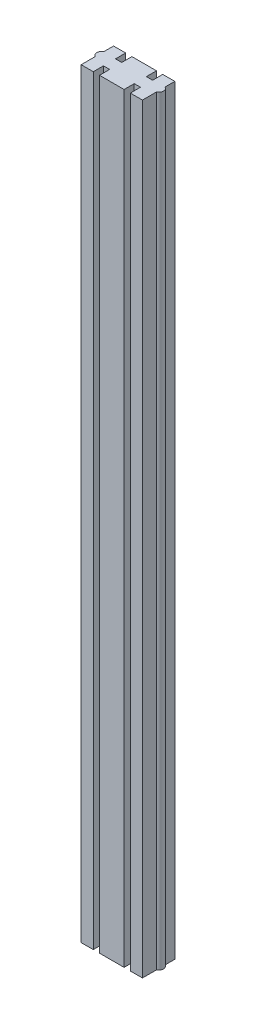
ISO-10303-21;
HEADER;
FILE_DESCRIPTION(('STEP AP214'),'2;1');
FILE_NAME('part.step','',(''),(''),'','','');
FILE_SCHEMA(('AUTOMOTIVE_DESIGN { 1 0 10303 214 1 1 1 1 }'));
ENDSEC;
DATA;
#1=APPLICATION_CONTEXT('core data for automotive mechanical design processes');
#2=APPLICATION_PROTOCOL_DEFINITION('international standard','automotive_design',2000,#1);
#3=PRODUCT_CONTEXT('',#1,'mechanical');
#4=PRODUCT('Part','Part','',(#3));
#5=PRODUCT_RELATED_PRODUCT_CATEGORY('part','',(#4));
#6=PRODUCT_DEFINITION_FORMATION('','',#4);
#7=PRODUCT_DEFINITION_CONTEXT('part definition',#1,'design');
#8=PRODUCT_DEFINITION('design','',#6,#7);
#9=PRODUCT_DEFINITION_SHAPE('','',#8);
#10=(LENGTH_UNIT() NAMED_UNIT(*) SI_UNIT(.MILLI.,.METRE.));
#11=(NAMED_UNIT(*) PLANE_ANGLE_UNIT() SI_UNIT($,.RADIAN.));
#12=(NAMED_UNIT(*) SI_UNIT($,.STERADIAN.) SOLID_ANGLE_UNIT());
#13=UNCERTAINTY_MEASURE_WITH_UNIT(LENGTH_MEASURE(1.E-05),#10,'distance_accuracy_value','');
#14=(GEOMETRIC_REPRESENTATION_CONTEXT(3) GLOBAL_UNCERTAINTY_ASSIGNED_CONTEXT((#13)) GLOBAL_UNIT_ASSIGNED_CONTEXT((#10,
#11,#12)) REPRESENTATION_CONTEXT('',''));
#15=CARTESIAN_POINT('',(0.,0.,0.));
#16=DIRECTION('',(0.,0.,1.));
#17=DIRECTION('',(1.,0.,0.));
#18=AXIS2_PLACEMENT_3D('',#15,#16,#17);
#19=CARTESIAN_POINT('',(0.,495.0079,0.));
#20=DIRECTION('',(1.,0.,0.));
#21=DIRECTION('',(0.,0.,-1.));
#22=AXIS2_PLACEMENT_3D('',#19,#20,#21);
#23=PLANE('',#22);
#24=DIRECTION('',(0.,0.,1.));
#25=VECTOR('',#24,1.);
#26=CARTESIAN_POINT('',(0.,0.,0.));
#27=LINE('',#26,#25);
#28=CARTESIAN_POINT('',(0.,0.,-9.16718712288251));
#29=VERTEX_POINT('',#28);
#30=CARTESIAN_POINT('',(0.,0.,0.));
#31=VERTEX_POINT('',#30);
#32=EDGE_CURVE('E236',#29,#31,#27,.T.);
#33=ORIENTED_EDGE('',*,*,#32,.T.);
#34=DIRECTION('',(0.,-1.,0.));
#35=VECTOR('',#34,1.);
#36=CARTESIAN_POINT('',(0.,495.0079,0.));
#37=LINE('',#36,#35);
#38=CARTESIAN_POINT('',(0.,495.0079,0.));
#39=VERTEX_POINT('',#38);
#40=EDGE_CURVE('E11',#39,#31,#37,.T.);
#41=ORIENTED_EDGE('',*,*,#40,.F.);
#42=DIRECTION('',(0.,0.,1.));
#43=VECTOR('',#42,1.);
#44=CARTESIAN_POINT('',(0.,495.0079,0.));
#45=LINE('',#44,#43);
#46=CARTESIAN_POINT('',(0.,495.0079,-9.16718712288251));
#47=VERTEX_POINT('',#46);
#48=EDGE_CURVE('E306',#47,#39,#45,.T.);
#49=ORIENTED_EDGE('',*,*,#48,.F.);
#50=DIRECTION('',(0.,-1.,0.));
#51=VECTOR('',#50,1.);
#52=CARTESIAN_POINT('',(0.,495.0079,-9.16718712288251));
#53=LINE('',#52,#51);
#54=EDGE_CURVE('E232',#47,#29,#53,.T.);
#55=ORIENTED_EDGE('',*,*,#54,.T.);
#56=EDGE_LOOP('',(#33,#41,#49,#55));
#57=FACE_BOUND('',#56,.T.);
#58=ADVANCED_FACE('F39',(#57),#23,.F.);
#59=CARTESIAN_POINT('',(0.,495.0079,0.));
#60=DIRECTION('',(0.,0.,-1.));
#61=DIRECTION('',(-1.,0.,0.));
#62=AXIS2_PLACEMENT_3D('',#59,#60,#61);
#63=PLANE('',#62);
#64=DIRECTION('',(1.,0.,0.));
#65=VECTOR('',#64,1.);
#66=CARTESIAN_POINT('',(0.,0.,0.));
#67=LINE('',#66,#65);
#68=CARTESIAN_POINT('',(7.874,0.,0.));
#69=VERTEX_POINT('',#68);
#70=EDGE_CURVE('E240',#31,#69,#67,.T.);
#71=ORIENTED_EDGE('',*,*,#70,.T.);
#72=DIRECTION('',(0.,-1.,0.));
#73=VECTOR('',#72,1.);
#74=CARTESIAN_POINT('',(7.874,495.0079,0.));
#75=LINE('',#74,#73);
#76=CARTESIAN_POINT('',(7.874,495.0079,0.));
#77=VERTEX_POINT('',#76);
#78=EDGE_CURVE('E48',#77,#69,#75,.T.);
#79=ORIENTED_EDGE('',*,*,#78,.F.);
#80=DIRECTION('',(1.,0.,0.));
#81=VECTOR('',#80,1.);
#82=CARTESIAN_POINT('',(0.,495.0079,0.));
#83=LINE('',#82,#81);
#84=EDGE_CURVE('E147',#39,#77,#83,.T.);
#85=ORIENTED_EDGE('',*,*,#84,.F.);
#86=ORIENTED_EDGE('',*,*,#40,.T.);
#87=EDGE_LOOP('',(#71,#79,#85,#86));
#88=FACE_BOUND('',#87,.T.);
#89=ADVANCED_FACE('F484',(#88),#63,.F.);
#90=CARTESIAN_POINT('',(7.874,495.0079,0.));
#91=DIRECTION('',(-1.,0.,0.));
#92=DIRECTION('',(0.,0.,1.));
#93=AXIS2_PLACEMENT_3D('',#90,#91,#92);
#94=PLANE('',#93);
#95=DIRECTION('',(0.,0.,-1.));
#96=VECTOR('',#95,1.);
#97=CARTESIAN_POINT('',(7.874,0.,0.));
#98=LINE('',#97,#96);
#99=CARTESIAN_POINT('',(7.874,0.,-6.604));
#100=VERTEX_POINT('',#99);
#101=EDGE_CURVE('E243',#69,#100,#98,.T.);
#102=ORIENTED_EDGE('',*,*,#101,.T.);
#103=DIRECTION('',(0.,-1.,0.));
#104=VECTOR('',#103,1.);
#105=CARTESIAN_POINT('',(7.874,495.0079,-6.604));
#106=LINE('',#105,#104);
#107=CARTESIAN_POINT('',(7.874,495.0079,-6.604));
#108=VERTEX_POINT('',#107);
#109=EDGE_CURVE('E381',#108,#100,#106,.T.);
#110=ORIENTED_EDGE('',*,*,#109,.F.);
#111=DIRECTION('',(0.,0.,-1.));
#112=VECTOR('',#111,1.);
#113=CARTESIAN_POINT('',(7.874,495.0079,0.));
#114=LINE('',#113,#112);
#115=EDGE_CURVE('E391',#77,#108,#114,.T.);
#116=ORIENTED_EDGE('',*,*,#115,.F.);
#117=ORIENTED_EDGE('',*,*,#78,.T.);
#118=EDGE_LOOP('',(#102,#110,#116,#117));
#119=FACE_BOUND('',#118,.T.);
#120=ADVANCED_FACE('F389',(#119),#94,.F.);
#121=CARTESIAN_POINT('',(7.874,495.0079,-6.604));
#122=DIRECTION('',(0.,0.,-1.));
#123=DIRECTION('',(-1.,0.,0.));
#124=AXIS2_PLACEMENT_3D('',#121,#122,#123);
#125=PLANE('',#124);
#126=DIRECTION('',(1.,0.,0.));
#127=VECTOR('',#126,1.);
#128=CARTESIAN_POINT('',(7.874,0.,-6.604));
#129=LINE('',#128,#127);
#130=CARTESIAN_POINT('',(11.938,0.,-6.604));
#131=VERTEX_POINT('',#130);
#132=EDGE_CURVE('E246',#100,#131,#129,.T.);
#133=ORIENTED_EDGE('',*,*,#132,.T.);
#134=DIRECTION('',(0.,-1.,0.));
#135=VECTOR('',#134,1.);
#136=CARTESIAN_POINT('',(11.938,495.0079,-6.604));
#137=LINE('',#136,#135);
#138=CARTESIAN_POINT('',(11.938,495.0079,-6.604));
#139=VERTEX_POINT('',#138);
#140=EDGE_CURVE('E377',#139,#131,#137,.T.);
#141=ORIENTED_EDGE('',*,*,#140,.F.);
#142=DIRECTION('',(1.,0.,0.));
#143=VECTOR('',#142,1.);
#144=CARTESIAN_POINT('',(7.874,495.0079,-6.604));
#145=LINE('',#144,#143);
#146=EDGE_CURVE('E410',#108,#139,#145,.T.);
#147=ORIENTED_EDGE('',*,*,#146,.F.);
#148=ORIENTED_EDGE('',*,*,#109,.T.);
#149=EDGE_LOOP('',(#133,#141,#147,#148));
#150=FACE_BOUND('',#149,.T.);
#151=ADVANCED_FACE('F400',(#150),#125,.F.);
#152=CARTESIAN_POINT('',(11.938,495.0079,0.));
#153=DIRECTION('',(1.,0.,0.));
#154=DIRECTION('',(0.,0.,-1.));
#155=AXIS2_PLACEMENT_3D('',#152,#153,#154);
#156=PLANE('',#155);
#157=DIRECTION('',(0.,0.,1.));
#158=VECTOR('',#157,1.);
#159=CARTESIAN_POINT('',(11.938,0.,0.));
#160=LINE('',#159,#158);
#161=CARTESIAN_POINT('',(11.938,0.,0.));
#162=VERTEX_POINT('',#161);
#163=EDGE_CURVE('E249',#131,#162,#160,.T.);
#164=ORIENTED_EDGE('',*,*,#163,.T.);
#165=DIRECTION('',(0.,-1.,0.));
#166=VECTOR('',#165,1.);
#167=CARTESIAN_POINT('',(11.938,495.0079,0.));
#168=LINE('',#167,#166);
#169=CARTESIAN_POINT('',(11.938,495.0079,0.));
#170=VERTEX_POINT('',#169);
#171=EDGE_CURVE('E373',#170,#162,#168,.T.);
#172=ORIENTED_EDGE('',*,*,#171,.F.);
#173=DIRECTION('',(0.,0.,1.));
#174=VECTOR('',#173,1.);
#175=CARTESIAN_POINT('',(11.938,495.0079,0.));
#176=LINE('',#175,#174);
#177=EDGE_CURVE('E406',#139,#170,#176,.T.);
#178=ORIENTED_EDGE('',*,*,#177,.F.);
#179=ORIENTED_EDGE('',*,*,#140,.T.);
#180=EDGE_LOOP('',(#164,#172,#178,#179));
#181=FACE_BOUND('',#180,.T.);
#182=ADVANCED_FACE('F404',(#181),#156,.F.);
#183=CARTESIAN_POINT('',(11.938,495.0079,0.));
#184=DIRECTION('',(0.,0.,-1.));
#185=DIRECTION('',(-1.,0.,0.));
#186=AXIS2_PLACEMENT_3D('',#183,#184,#185);
#187=PLANE('',#186);
#188=DIRECTION('',(1.,0.,0.));
#189=VECTOR('',#188,1.);
#190=CARTESIAN_POINT('',(11.938,0.,0.));
#191=LINE('',#190,#189);
#192=CARTESIAN_POINT('',(27.94,0.,0.));
#193=VERTEX_POINT('',#192);
#194=EDGE_CURVE('E252',#162,#193,#191,.T.);
#195=ORIENTED_EDGE('',*,*,#194,.T.);
#196=DIRECTION('',(0.,-1.,0.));
#197=VECTOR('',#196,1.);
#198=CARTESIAN_POINT('',(27.94,495.0079,0.));
#199=LINE('',#198,#197);
#200=CARTESIAN_POINT('',(27.94,495.0079,0.));
#201=VERTEX_POINT('',#200);
#202=EDGE_CURVE('E369',#201,#193,#199,.T.);
#203=ORIENTED_EDGE('',*,*,#202,.F.);
#204=DIRECTION('',(1.,0.,0.));
#205=VECTOR('',#204,1.);
#206=CARTESIAN_POINT('',(11.938,495.0079,0.));
#207=LINE('',#206,#205);
#208=EDGE_CURVE('E409',#170,#201,#207,.T.);
#209=ORIENTED_EDGE('',*,*,#208,.F.);
#210=ORIENTED_EDGE('',*,*,#171,.T.);
#211=EDGE_LOOP('',(#195,#203,#209,#210));
#212=FACE_BOUND('',#211,.T.);
#213=ADVANCED_FACE('F497',(#212),#187,.F.);
#214=CARTESIAN_POINT('',(27.94,495.0079,0.));
#215=DIRECTION('',(-1.,0.,0.));
#216=DIRECTION('',(0.,0.,1.));
#217=AXIS2_PLACEMENT_3D('',#214,#215,#216);
#218=PLANE('',#217);
#219=DIRECTION('',(0.,0.,-1.));
#220=VECTOR('',#219,1.);
#221=CARTESIAN_POINT('',(27.94,0.,0.));
#222=LINE('',#221,#220);
#223=CARTESIAN_POINT('',(27.94,0.,-6.604));
#224=VERTEX_POINT('',#223);
#225=EDGE_CURVE('E255',#193,#224,#222,.T.);
#226=ORIENTED_EDGE('',*,*,#225,.T.);
#227=DIRECTION('',(0.,-1.,0.));
#228=VECTOR('',#227,1.);
#229=CARTESIAN_POINT('',(27.94,495.0079,-6.604));
#230=LINE('',#229,#228);
#231=CARTESIAN_POINT('',(27.94,495.0079,-6.604));
#232=VERTEX_POINT('',#231);
#233=EDGE_CURVE('E365',#232,#224,#230,.T.);
#234=ORIENTED_EDGE('',*,*,#233,.F.);
#235=DIRECTION('',(0.,0.,-1.));
#236=VECTOR('',#235,1.);
#237=CARTESIAN_POINT('',(27.94,495.0079,0.));
#238=LINE('',#237,#236);
#239=EDGE_CURVE('E414',#201,#232,#238,.T.);
#240=ORIENTED_EDGE('',*,*,#239,.F.);
#241=ORIENTED_EDGE('',*,*,#202,.T.);
#242=EDGE_LOOP('',(#226,#234,#240,#241));
#243=FACE_BOUND('',#242,.T.);
#244=ADVANCED_FACE('F500',(#243),#218,.F.);
#245=CARTESIAN_POINT('',(32.004,495.0079,-6.604));
#246=DIRECTION('',(0.,0.,-1.));
#247=DIRECTION('',(-1.,0.,0.));
#248=AXIS2_PLACEMENT_3D('',#245,#246,#247);
#249=PLANE('',#248);
#250=DIRECTION('',(1.,0.,0.));
#251=VECTOR('',#250,1.);
#252=CARTESIAN_POINT('',(32.004,0.,-6.604));
#253=LINE('',#252,#251);
#254=CARTESIAN_POINT('',(32.004,0.,-6.604));
#255=VERTEX_POINT('',#254);
#256=EDGE_CURVE('E258',#224,#255,#253,.T.);
#257=ORIENTED_EDGE('',*,*,#256,.T.);
#258=DIRECTION('',(0.,-1.,0.));
#259=VECTOR('',#258,1.);
#260=CARTESIAN_POINT('',(32.004,495.0079,-6.604));
#261=LINE('',#260,#259);
#262=CARTESIAN_POINT('',(32.004,495.0079,-6.604));
#263=VERTEX_POINT('',#262);
#264=EDGE_CURVE('E361',#263,#255,#261,.T.);
#265=ORIENTED_EDGE('',*,*,#264,.F.);
#266=DIRECTION('',(1.,0.,0.));
#267=VECTOR('',#266,1.);
#268=CARTESIAN_POINT('',(32.004,495.0079,-6.604));
#269=LINE('',#268,#267);
#270=EDGE_CURVE('E421',#232,#263,#269,.T.);
#271=ORIENTED_EDGE('',*,*,#270,.F.);
#272=ORIENTED_EDGE('',*,*,#233,.T.);
#273=EDGE_LOOP('',(#257,#265,#271,#272));
#274=FACE_BOUND('',#273,.T.);
#275=ADVANCED_FACE('F504',(#274),#249,.F.);
#276=CARTESIAN_POINT('',(32.004,495.0079,0.));
#277=DIRECTION('',(1.,0.,0.));
#278=DIRECTION('',(0.,0.,-1.));
#279=AXIS2_PLACEMENT_3D('',#276,#277,#278);
#280=PLANE('',#279);
#281=DIRECTION('',(0.,0.,1.));
#282=VECTOR('',#281,1.);
#283=CARTESIAN_POINT('',(32.004,0.,0.));
#284=LINE('',#283,#282);
#285=CARTESIAN_POINT('',(32.004,0.,0.));
#286=VERTEX_POINT('',#285);
#287=EDGE_CURVE('E261',#255,#286,#284,.T.);
#288=ORIENTED_EDGE('',*,*,#287,.T.);
#289=DIRECTION('',(0.,-1.,0.));
#290=VECTOR('',#289,1.);
#291=CARTESIAN_POINT('',(32.004,495.0079,0.));
#292=LINE('',#291,#290);
#293=CARTESIAN_POINT('',(32.004,495.0079,0.));
#294=VERTEX_POINT('',#293);
#295=EDGE_CURVE('E357',#294,#286,#292,.T.);
#296=ORIENTED_EDGE('',*,*,#295,.F.);
#297=DIRECTION('',(0.,0.,1.));
#298=VECTOR('',#297,1.);
#299=CARTESIAN_POINT('',(32.004,495.0079,0.));
#300=LINE('',#299,#298);
#301=EDGE_CURVE('E424',#263,#294,#300,.T.);
#302=ORIENTED_EDGE('',*,*,#301,.F.);
#303=ORIENTED_EDGE('',*,*,#264,.T.);
#304=EDGE_LOOP('',(#288,#296,#302,#303));
#305=FACE_BOUND('',#304,.T.);
#306=ADVANCED_FACE('F508',(#305),#280,.F.);
#307=CARTESIAN_POINT('',(32.004,495.0079,0.));
#308=DIRECTION('',(0.,0.,-1.));
#309=DIRECTION('',(-1.,0.,0.));
#310=AXIS2_PLACEMENT_3D('',#307,#308,#309);
#311=PLANE('',#310);
#312=DIRECTION('',(1.,0.,0.));
#313=VECTOR('',#312,1.);
#314=CARTESIAN_POINT('',(32.004,0.,0.));
#315=LINE('',#314,#313);
#316=CARTESIAN_POINT('',(39.878,0.,0.));
#317=VERTEX_POINT('',#316);
#318=EDGE_CURVE('E264',#286,#317,#315,.T.);
#319=ORIENTED_EDGE('',*,*,#318,.T.);
#320=DIRECTION('',(0.,-1.,0.));
#321=VECTOR('',#320,1.);
#322=CARTESIAN_POINT('',(39.878,495.0079,0.));
#323=LINE('',#322,#321);
#324=CARTESIAN_POINT('',(39.878,495.0079,0.));
#325=VERTEX_POINT('',#324);
#326=EDGE_CURVE('E353',#325,#317,#323,.T.);
#327=ORIENTED_EDGE('',*,*,#326,.F.);
#328=DIRECTION('',(1.,0.,0.));
#329=VECTOR('',#328,1.);
#330=CARTESIAN_POINT('',(32.004,495.0079,0.));
#331=LINE('',#330,#329);
#332=EDGE_CURVE('E427',#294,#325,#331,.T.);
#333=ORIENTED_EDGE('',*,*,#332,.F.);
#334=ORIENTED_EDGE('',*,*,#295,.T.);
#335=EDGE_LOOP('',(#319,#327,#333,#334));
#336=FACE_BOUND('',#335,.T.);
#337=ADVANCED_FACE('F512',(#336),#311,.F.);
#338=CARTESIAN_POINT('',(39.878,495.0079,0.));
#339=DIRECTION('',(-1.,0.,0.));
#340=DIRECTION('',(0.,0.,1.));
#341=AXIS2_PLACEMENT_3D('',#338,#339,#340);
#342=PLANE('',#341);
#343=DIRECTION('',(0.,0.,-1.));
#344=VECTOR('',#343,1.);
#345=CARTESIAN_POINT('',(39.878,0.,0.));
#346=LINE('',#345,#344);
#347=CARTESIAN_POINT('',(39.878,0.,-9.16718712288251));
#348=VERTEX_POINT('',#347);
#349=EDGE_CURVE('E267',#317,#348,#346,.T.);
#350=ORIENTED_EDGE('',*,*,#349,.T.);
#351=DIRECTION('',(0.,-1.,0.));
#352=VECTOR('',#351,1.);
#353=CARTESIAN_POINT('',(39.878,495.0079,-9.16718712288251));
#354=LINE('',#353,#352);
#355=CARTESIAN_POINT('',(39.878,495.0079,-9.16718712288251));
#356=VERTEX_POINT('',#355);
#357=EDGE_CURVE('E349',#356,#348,#354,.T.);
#358=ORIENTED_EDGE('',*,*,#357,.F.);
#359=DIRECTION('',(0.,0.,-1.));
#360=VECTOR('',#359,1.);
#361=CARTESIAN_POINT('',(39.878,495.0079,0.));
#362=LINE('',#361,#360);
#363=EDGE_CURVE('E430',#325,#356,#362,.T.);
#364=ORIENTED_EDGE('',*,*,#363,.F.);
#365=ORIENTED_EDGE('',*,*,#326,.T.);
#366=EDGE_LOOP('',(#350,#358,#364,#365));
#367=FACE_BOUND('',#366,.T.);
#368=ADVANCED_FACE('F516',(#367),#342,.F.);
#369=CARTESIAN_POINT('',(38.608,495.0079,-11.938));
#370=DIRECTION('',(0.,-1.,0.));
#371=DIRECTION('',(0.,0.,-1.));
#372=AXIS2_PLACEMENT_3D('',#369,#370,#371);
#373=CYLINDRICAL_SURFACE('',#372,3.04800000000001);
#374=CARTESIAN_POINT('',(38.608,0.,-11.938));
#375=DIRECTION('',(0.,1.,0.));
#376=DIRECTION('',(0.,0.,1.));
#377=AXIS2_PLACEMENT_3D('',#374,#375,#376);
#378=CIRCLE('',#377,3.04800000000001);
#379=CARTESIAN_POINT('',(39.878,0.,-14.7088128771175));
#380=VERTEX_POINT('',#379);
#381=EDGE_CURVE('E270',#348,#380,#378,.T.);
#382=ORIENTED_EDGE('',*,*,#381,.T.);
#383=DIRECTION('',(0.,-1.,0.));
#384=VECTOR('',#383,1.);
#385=CARTESIAN_POINT('',(39.878,495.0079,-14.7088128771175));
#386=LINE('',#385,#384);
#387=CARTESIAN_POINT('',(39.878,495.0079,-14.7088128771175));
#388=VERTEX_POINT('',#387);
#389=EDGE_CURVE('E345',#388,#380,#386,.T.);
#390=ORIENTED_EDGE('',*,*,#389,.F.);
#391=CARTESIAN_POINT('',(38.608,495.0079,-11.938));
#392=DIRECTION('',(0.,1.,0.));
#393=DIRECTION('',(0.,0.,1.));
#394=AXIS2_PLACEMENT_3D('',#391,#392,#393);
#395=CIRCLE('',#394,3.04800000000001);
#396=EDGE_CURVE('E433',#356,#388,#395,.T.);
#397=ORIENTED_EDGE('',*,*,#396,.F.);
#398=ORIENTED_EDGE('',*,*,#357,.T.);
#399=EDGE_LOOP('',(#382,#390,#397,#398));
#400=FACE_BOUND('',#399,.T.);
#401=ADVANCED_FACE('F520',(#400),#373,.T.);
#402=CARTESIAN_POINT('',(39.878,495.0079,-14.7088128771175));
#403=DIRECTION('',(-1.,0.,0.));
#404=DIRECTION('',(0.,0.,1.));
#405=AXIS2_PLACEMENT_3D('',#402,#403,#404);
#406=PLANE('',#405);
#407=DIRECTION('',(0.,0.,-1.));
#408=VECTOR('',#407,1.);
#409=CARTESIAN_POINT('',(39.878,0.,-14.7088128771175));
#410=LINE('',#409,#408);
#411=CARTESIAN_POINT('',(39.878,0.,-21.082));
#412=VERTEX_POINT('',#411);
#413=EDGE_CURVE('E273',#380,#412,#410,.T.);
#414=ORIENTED_EDGE('',*,*,#413,.T.);
#415=DIRECTION('',(0.,-1.,0.));
#416=VECTOR('',#415,1.);
#417=CARTESIAN_POINT('',(39.878,495.0079,-21.082));
#418=LINE('',#417,#416);
#419=CARTESIAN_POINT('',(39.878,495.0079,-21.082));
#420=VERTEX_POINT('',#419);
#421=EDGE_CURVE('E341',#420,#412,#418,.T.);
#422=ORIENTED_EDGE('',*,*,#421,.F.);
#423=DIRECTION('',(0.,0.,-1.));
#424=VECTOR('',#423,1.);
#425=CARTESIAN_POINT('',(39.878,495.0079,-14.7088128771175));
#426=LINE('',#425,#424);
#427=EDGE_CURVE('E436',#388,#420,#426,.T.);
#428=ORIENTED_EDGE('',*,*,#427,.F.);
#429=ORIENTED_EDGE('',*,*,#389,.T.);
#430=EDGE_LOOP('',(#414,#422,#428,#429));
#431=FACE_BOUND('',#430,.T.);
#432=ADVANCED_FACE('F524',(#431),#406,.F.);
#433=CARTESIAN_POINT('',(32.004,495.0079,-21.082));
#434=DIRECTION('',(0.,0.,1.));
#435=DIRECTION('',(1.,0.,0.));
#436=AXIS2_PLACEMENT_3D('',#433,#434,#435);
#437=PLANE('',#436);
#438=DIRECTION('',(-1.,0.,0.));
#439=VECTOR('',#438,1.);
#440=CARTESIAN_POINT('',(32.004,0.,-21.082));
#441=LINE('',#440,#439);
#442=CARTESIAN_POINT('',(32.004,0.,-21.082));
#443=VERTEX_POINT('',#442);
#444=EDGE_CURVE('E276',#412,#443,#441,.T.);
#445=ORIENTED_EDGE('',*,*,#444,.T.);
#446=DIRECTION('',(0.,-1.,0.));
#447=VECTOR('',#446,1.);
#448=CARTESIAN_POINT('',(32.004,495.0079,-21.082));
#449=LINE('',#448,#447);
#450=CARTESIAN_POINT('',(32.004,495.0079,-21.082));
#451=VERTEX_POINT('',#450);
#452=EDGE_CURVE('E337',#451,#443,#449,.T.);
#453=ORIENTED_EDGE('',*,*,#452,.F.);
#454=DIRECTION('',(-1.,0.,0.));
#455=VECTOR('',#454,1.);
#456=CARTESIAN_POINT('',(32.004,495.0079,-21.082));
#457=LINE('',#456,#455);
#458=EDGE_CURVE('E439',#420,#451,#457,.T.);
#459=ORIENTED_EDGE('',*,*,#458,.F.);
#460=ORIENTED_EDGE('',*,*,#421,.T.);
#461=EDGE_LOOP('',(#445,#453,#459,#460));
#462=FACE_BOUND('',#461,.T.);
#463=ADVANCED_FACE('F528',(#462),#437,.F.);
#464=CARTESIAN_POINT('',(32.004,495.0079,-21.082));
#465=DIRECTION('',(1.,0.,0.));
#466=DIRECTION('',(0.,0.,-1.));
#467=AXIS2_PLACEMENT_3D('',#464,#465,#466);
#468=PLANE('',#467);
#469=DIRECTION('',(0.,0.,1.));
#470=VECTOR('',#469,1.);
#471=CARTESIAN_POINT('',(32.004,0.,-21.082));
#472=LINE('',#471,#470);
#473=CARTESIAN_POINT('',(32.004,0.,-14.478));
#474=VERTEX_POINT('',#473);
#475=EDGE_CURVE('E279',#443,#474,#472,.T.);
#476=ORIENTED_EDGE('',*,*,#475,.T.);
#477=DIRECTION('',(0.,-1.,0.));
#478=VECTOR('',#477,1.);
#479=CARTESIAN_POINT('',(32.004,495.0079,-14.478));
#480=LINE('',#479,#478);
#481=CARTESIAN_POINT('',(32.004,495.0079,-14.478));
#482=VERTEX_POINT('',#481);
#483=EDGE_CURVE('E333',#482,#474,#480,.T.);
#484=ORIENTED_EDGE('',*,*,#483,.F.);
#485=DIRECTION('',(0.,0.,1.));
#486=VECTOR('',#485,1.);
#487=CARTESIAN_POINT('',(32.004,495.0079,-21.082));
#488=LINE('',#487,#486);
#489=EDGE_CURVE('E442',#451,#482,#488,.T.);
#490=ORIENTED_EDGE('',*,*,#489,.F.);
#491=ORIENTED_EDGE('',*,*,#452,.T.);
#492=EDGE_LOOP('',(#476,#484,#490,#491));
#493=FACE_BOUND('',#492,.T.);
#494=ADVANCED_FACE('F532',(#493),#468,.F.);
#495=CARTESIAN_POINT('',(32.004,495.0079,-14.478));
#496=DIRECTION('',(0.,0.,1.));
#497=DIRECTION('',(1.,0.,0.));
#498=AXIS2_PLACEMENT_3D('',#495,#496,#497);
#499=PLANE('',#498);
#500=DIRECTION('',(-1.,0.,0.));
#501=VECTOR('',#500,1.);
#502=CARTESIAN_POINT('',(32.004,0.,-14.478));
#503=LINE('',#502,#501);
#504=CARTESIAN_POINT('',(27.94,0.,-14.478));
#505=VERTEX_POINT('',#504);
#506=EDGE_CURVE('E282',#474,#505,#503,.T.);
#507=ORIENTED_EDGE('',*,*,#506,.T.);
#508=DIRECTION('',(0.,-1.,0.));
#509=VECTOR('',#508,1.);
#510=CARTESIAN_POINT('',(27.94,495.0079,-14.478));
#511=LINE('',#510,#509);
#512=CARTESIAN_POINT('',(27.94,495.0079,-14.478));
#513=VERTEX_POINT('',#512);
#514=EDGE_CURVE('E329',#513,#505,#511,.T.);
#515=ORIENTED_EDGE('',*,*,#514,.F.);
#516=DIRECTION('',(-1.,0.,0.));
#517=VECTOR('',#516,1.);
#518=CARTESIAN_POINT('',(32.004,495.0079,-14.478));
#519=LINE('',#518,#517);
#520=EDGE_CURVE('E445',#482,#513,#519,.T.);
#521=ORIENTED_EDGE('',*,*,#520,.F.);
#522=ORIENTED_EDGE('',*,*,#483,.T.);
#523=EDGE_LOOP('',(#507,#515,#521,#522));
#524=FACE_BOUND('',#523,.T.);
#525=ADVANCED_FACE('F536',(#524),#499,.F.);
#526=CARTESIAN_POINT('',(27.94,495.0079,-21.082));
#527=DIRECTION('',(-1.,0.,0.));
#528=DIRECTION('',(0.,0.,1.));
#529=AXIS2_PLACEMENT_3D('',#526,#527,#528);
#530=PLANE('',#529);
#531=DIRECTION('',(0.,0.,-1.));
#532=VECTOR('',#531,1.);
#533=CARTESIAN_POINT('',(27.94,0.,-21.082));
#534=LINE('',#533,#532);
#535=CARTESIAN_POINT('',(27.94,0.,-21.082));
#536=VERTEX_POINT('',#535);
#537=EDGE_CURVE('E285',#505,#536,#534,.T.);
#538=ORIENTED_EDGE('',*,*,#537,.T.);
#539=DIRECTION('',(0.,-1.,0.));
#540=VECTOR('',#539,1.);
#541=CARTESIAN_POINT('',(27.94,495.0079,-21.082));
#542=LINE('',#541,#540);
#543=CARTESIAN_POINT('',(27.94,495.0079,-21.082));
#544=VERTEX_POINT('',#543);
#545=EDGE_CURVE('E325',#544,#536,#542,.T.);
#546=ORIENTED_EDGE('',*,*,#545,.F.);
#547=DIRECTION('',(0.,0.,-1.));
#548=VECTOR('',#547,1.);
#549=CARTESIAN_POINT('',(27.94,495.0079,-21.082));
#550=LINE('',#549,#548);
#551=EDGE_CURVE('E448',#513,#544,#550,.T.);
#552=ORIENTED_EDGE('',*,*,#551,.F.);
#553=ORIENTED_EDGE('',*,*,#514,.T.);
#554=EDGE_LOOP('',(#538,#546,#552,#553));
#555=FACE_BOUND('',#554,.T.);
#556=ADVANCED_FACE('F540',(#555),#530,.F.);
#557=CARTESIAN_POINT('',(11.938,495.0079,-21.082));
#558=DIRECTION('',(0.,0.,1.));
#559=DIRECTION('',(1.,0.,0.));
#560=AXIS2_PLACEMENT_3D('',#557,#558,#559);
#561=PLANE('',#560);
#562=DIRECTION('',(-1.,0.,0.));
#563=VECTOR('',#562,1.);
#564=CARTESIAN_POINT('',(11.938,0.,-21.082));
#565=LINE('',#564,#563);
#566=CARTESIAN_POINT('',(11.938,0.,-21.082));
#567=VERTEX_POINT('',#566);
#568=EDGE_CURVE('E288',#536,#567,#565,.T.);
#569=ORIENTED_EDGE('',*,*,#568,.T.);
#570=DIRECTION('',(0.,-1.,0.));
#571=VECTOR('',#570,1.);
#572=CARTESIAN_POINT('',(11.938,495.0079,-21.082));
#573=LINE('',#572,#571);
#574=CARTESIAN_POINT('',(11.938,495.0079,-21.082));
#575=VERTEX_POINT('',#574);
#576=EDGE_CURVE('E321',#575,#567,#573,.T.);
#577=ORIENTED_EDGE('',*,*,#576,.F.);
#578=DIRECTION('',(-1.,0.,0.));
#579=VECTOR('',#578,1.);
#580=CARTESIAN_POINT('',(11.938,495.0079,-21.082));
#581=LINE('',#580,#579);
#582=EDGE_CURVE('E451',#544,#575,#581,.T.);
#583=ORIENTED_EDGE('',*,*,#582,.F.);
#584=ORIENTED_EDGE('',*,*,#545,.T.);
#585=EDGE_LOOP('',(#569,#577,#583,#584));
#586=FACE_BOUND('',#585,.T.);
#587=ADVANCED_FACE('F544',(#586),#561,.F.);
#588=CARTESIAN_POINT('',(11.938,495.0079,-21.082));
#589=DIRECTION('',(1.,0.,0.));
#590=DIRECTION('',(0.,0.,-1.));
#591=AXIS2_PLACEMENT_3D('',#588,#589,#590);
#592=PLANE('',#591);
#593=DIRECTION('',(0.,0.,1.));
#594=VECTOR('',#593,1.);
#595=CARTESIAN_POINT('',(11.938,0.,-21.082));
#596=LINE('',#595,#594);
#597=CARTESIAN_POINT('',(11.938,0.,-14.478));
#598=VERTEX_POINT('',#597);
#599=EDGE_CURVE('E291',#567,#598,#596,.T.);
#600=ORIENTED_EDGE('',*,*,#599,.T.);
#601=DIRECTION('',(0.,-1.,0.));
#602=VECTOR('',#601,1.);
#603=CARTESIAN_POINT('',(11.938,495.0079,-14.478));
#604=LINE('',#603,#602);
#605=CARTESIAN_POINT('',(11.938,495.0079,-14.478));
#606=VERTEX_POINT('',#605);
#607=EDGE_CURVE('E317',#606,#598,#604,.T.);
#608=ORIENTED_EDGE('',*,*,#607,.F.);
#609=DIRECTION('',(0.,0.,1.));
#610=VECTOR('',#609,1.);
#611=CARTESIAN_POINT('',(11.938,495.0079,-21.082));
#612=LINE('',#611,#610);
#613=EDGE_CURVE('E454',#575,#606,#612,.T.);
#614=ORIENTED_EDGE('',*,*,#613,.F.);
#615=ORIENTED_EDGE('',*,*,#576,.T.);
#616=EDGE_LOOP('',(#600,#608,#614,#615));
#617=FACE_BOUND('',#616,.T.);
#618=ADVANCED_FACE('F548',(#617),#592,.F.);
#619=CARTESIAN_POINT('',(7.874,495.0079,-14.478));
#620=DIRECTION('',(0.,0.,1.));
#621=DIRECTION('',(1.,0.,0.));
#622=AXIS2_PLACEMENT_3D('',#619,#620,#621);
#623=PLANE('',#622);
#624=DIRECTION('',(-1.,0.,0.));
#625=VECTOR('',#624,1.);
#626=CARTESIAN_POINT('',(7.874,0.,-14.478));
#627=LINE('',#626,#625);
#628=CARTESIAN_POINT('',(7.874,0.,-14.478));
#629=VERTEX_POINT('',#628);
#630=EDGE_CURVE('E294',#598,#629,#627,.T.);
#631=ORIENTED_EDGE('',*,*,#630,.T.);
#632=DIRECTION('',(0.,-1.,0.));
#633=VECTOR('',#632,1.);
#634=CARTESIAN_POINT('',(7.874,495.0079,-14.478));
#635=LINE('',#634,#633);
#636=CARTESIAN_POINT('',(7.874,495.0079,-14.478));
#637=VERTEX_POINT('',#636);
#638=EDGE_CURVE('E313',#637,#629,#635,.T.);
#639=ORIENTED_EDGE('',*,*,#638,.F.);
#640=DIRECTION('',(-1.,0.,0.));
#641=VECTOR('',#640,1.);
#642=CARTESIAN_POINT('',(7.874,495.0079,-14.478));
#643=LINE('',#642,#641);
#644=EDGE_CURVE('E457',#606,#637,#643,.T.);
#645=ORIENTED_EDGE('',*,*,#644,.F.);
#646=ORIENTED_EDGE('',*,*,#607,.T.);
#647=EDGE_LOOP('',(#631,#639,#645,#646));
#648=FACE_BOUND('',#647,.T.);
#649=ADVANCED_FACE('F465',(#648),#623,.F.);
#650=CARTESIAN_POINT('',(7.874,495.0079,-21.082));
#651=DIRECTION('',(-1.,0.,0.));
#652=DIRECTION('',(0.,0.,1.));
#653=AXIS2_PLACEMENT_3D('',#650,#651,#652);
#654=PLANE('',#653);
#655=DIRECTION('',(0.,0.,-1.));
#656=VECTOR('',#655,1.);
#657=CARTESIAN_POINT('',(7.874,0.,-21.082));
#658=LINE('',#657,#656);
#659=CARTESIAN_POINT('',(7.874,0.,-21.082));
#660=VERTEX_POINT('',#659);
#661=EDGE_CURVE('E297',#629,#660,#658,.T.);
#662=ORIENTED_EDGE('',*,*,#661,.T.);
#663=DIRECTION('',(0.,-1.,0.));
#664=VECTOR('',#663,1.);
#665=CARTESIAN_POINT('',(7.874,495.0079,-21.082));
#666=LINE('',#665,#664);
#667=CARTESIAN_POINT('',(7.874,495.0079,-21.082));
#668=VERTEX_POINT('',#667);
#669=EDGE_CURVE('E225',#668,#660,#666,.T.);
#670=ORIENTED_EDGE('',*,*,#669,.F.);
#671=DIRECTION('',(0.,0.,-1.));
#672=VECTOR('',#671,1.);
#673=CARTESIAN_POINT('',(7.874,495.0079,-21.082));
#674=LINE('',#673,#672);
#675=EDGE_CURVE('E214',#637,#668,#674,.T.);
#676=ORIENTED_EDGE('',*,*,#675,.F.);
#677=ORIENTED_EDGE('',*,*,#638,.T.);
#678=EDGE_LOOP('',(#662,#670,#676,#677));
#679=FACE_BOUND('',#678,.T.);
#680=ADVANCED_FACE('F469',(#679),#654,.F.);
#681=CARTESIAN_POINT('',(0.,495.0079,-21.082));
#682=DIRECTION('',(0.,0.,1.));
#683=DIRECTION('',(1.,0.,0.));
#684=AXIS2_PLACEMENT_3D('',#681,#682,#683);
#685=PLANE('',#684);
#686=DIRECTION('',(-1.,0.,0.));
#687=VECTOR('',#686,1.);
#688=CARTESIAN_POINT('',(0.,0.,-21.082));
#689=LINE('',#688,#687);
#690=CARTESIAN_POINT('',(0.,0.,-21.082));
#691=VERTEX_POINT('',#690);
#692=EDGE_CURVE('E223',#660,#691,#689,.T.);
#693=ORIENTED_EDGE('',*,*,#692,.T.);
#694=DIRECTION('',(0.,-1.,0.));
#695=VECTOR('',#694,1.);
#696=CARTESIAN_POINT('',(0.,495.0079,-21.082));
#697=LINE('',#696,#695);
#698=CARTESIAN_POINT('',(0.,495.0079,-21.082));
#699=VERTEX_POINT('',#698);
#700=EDGE_CURVE('E220',#699,#691,#697,.T.);
#701=ORIENTED_EDGE('',*,*,#700,.F.);
#702=DIRECTION('',(-1.,0.,0.));
#703=VECTOR('',#702,1.);
#704=CARTESIAN_POINT('',(0.,495.0079,-21.082));
#705=LINE('',#704,#703);
#706=EDGE_CURVE('E208',#668,#699,#705,.T.);
#707=ORIENTED_EDGE('',*,*,#706,.F.);
#708=ORIENTED_EDGE('',*,*,#669,.T.);
#709=EDGE_LOOP('',(#693,#701,#707,#708));
#710=FACE_BOUND('',#709,.T.);
#711=ADVANCED_FACE('F221',(#710),#685,.F.);
#712=CARTESIAN_POINT('',(0.,495.0079,-14.7088128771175));
#713=DIRECTION('',(1.,0.,0.));
#714=DIRECTION('',(0.,0.,-1.));
#715=AXIS2_PLACEMENT_3D('',#712,#713,#714);
#716=PLANE('',#715);
#717=DIRECTION('',(0.,0.,1.));
#718=VECTOR('',#717,1.);
#719=CARTESIAN_POINT('',(0.,0.,-14.7088128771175));
#720=LINE('',#719,#718);
#721=CARTESIAN_POINT('',(0.,0.,-14.7088128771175));
#722=VERTEX_POINT('',#721);
#723=EDGE_CURVE('E133',#691,#722,#720,.T.);
#724=ORIENTED_EDGE('',*,*,#723,.T.);
#725=DIRECTION('',(0.,-1.,0.));
#726=VECTOR('',#725,1.);
#727=CARTESIAN_POINT('',(0.,495.0079,-14.7088128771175));
#728=LINE('',#727,#726);
#729=CARTESIAN_POINT('',(0.,495.0079,-14.7088128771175));
#730=VERTEX_POINT('',#729);
#731=EDGE_CURVE('E226',#730,#722,#728,.T.);
#732=ORIENTED_EDGE('',*,*,#731,.F.);
#733=DIRECTION('',(0.,0.,1.));
#734=VECTOR('',#733,1.);
#735=CARTESIAN_POINT('',(0.,495.0079,-14.7088128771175));
#736=LINE('',#735,#734);
#737=EDGE_CURVE('E212',#699,#730,#736,.T.);
#738=ORIENTED_EDGE('',*,*,#737,.F.);
#739=ORIENTED_EDGE('',*,*,#700,.T.);
#740=EDGE_LOOP('',(#724,#732,#738,#739));
#741=FACE_BOUND('',#740,.T.);
#742=ADVANCED_FACE('F228',(#741),#716,.F.);
#743=CARTESIAN_POINT('',(1.26999999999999,495.0079,-11.938));
#744=DIRECTION('',(0.,-1.,0.));
#745=DIRECTION('',(0.,0.,-1.));
#746=AXIS2_PLACEMENT_3D('',#743,#744,#745);
#747=CYLINDRICAL_SURFACE('',#746,3.04800000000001);
#748=CARTESIAN_POINT('',(1.26999999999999,0.,-11.938));
#749=DIRECTION('',(0.,1.,0.));
#750=DIRECTION('',(0.,0.,-1.));
#751=AXIS2_PLACEMENT_3D('',#748,#749,#750);
#752=CIRCLE('',#751,3.04800000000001);
#753=EDGE_CURVE('E139',#722,#29,#752,.T.);
#754=ORIENTED_EDGE('',*,*,#753,.T.);
#755=ORIENTED_EDGE('',*,*,#54,.F.);
#756=CARTESIAN_POINT('',(1.26999999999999,495.0079,-11.938));
#757=DIRECTION('',(0.,1.,0.));
#758=DIRECTION('',(0.,0.,-1.));
#759=AXIS2_PLACEMENT_3D('',#756,#757,#758);
#760=CIRCLE('',#759,3.04800000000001);
#761=EDGE_CURVE('E56',#730,#47,#760,.T.);
#762=ORIENTED_EDGE('',*,*,#761,.F.);
#763=ORIENTED_EDGE('',*,*,#731,.T.);
#764=EDGE_LOOP('',(#754,#755,#762,#763));
#765=FACE_BOUND('',#764,.T.);
#766=ADVANCED_FACE('F473',(#765),#747,.T.);
#767=CARTESIAN_POINT('',(1.26999999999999,495.0079,-11.938));
#768=DIRECTION('',(0.,-1.,0.));
#769=DIRECTION('',(0.,0.,-1.));
#770=AXIS2_PLACEMENT_3D('',#767,#768,#769);
#771=PLANE('',#770);
#772=ORIENTED_EDGE('',*,*,#48,.T.);
#773=ORIENTED_EDGE('',*,*,#84,.T.);
#774=ORIENTED_EDGE('',*,*,#115,.T.);
#775=ORIENTED_EDGE('',*,*,#146,.T.);
#776=ORIENTED_EDGE('',*,*,#177,.T.);
#777=ORIENTED_EDGE('',*,*,#208,.T.);
#778=ORIENTED_EDGE('',*,*,#239,.T.);
#779=ORIENTED_EDGE('',*,*,#270,.T.);
#780=ORIENTED_EDGE('',*,*,#301,.T.);
#781=ORIENTED_EDGE('',*,*,#332,.T.);
#782=ORIENTED_EDGE('',*,*,#363,.T.);
#783=ORIENTED_EDGE('',*,*,#396,.T.);
#784=ORIENTED_EDGE('',*,*,#427,.T.);
#785=ORIENTED_EDGE('',*,*,#458,.T.);
#786=ORIENTED_EDGE('',*,*,#489,.T.);
#787=ORIENTED_EDGE('',*,*,#520,.T.);
#788=ORIENTED_EDGE('',*,*,#551,.T.);
#789=ORIENTED_EDGE('',*,*,#582,.T.);
#790=ORIENTED_EDGE('',*,*,#613,.T.);
#791=ORIENTED_EDGE('',*,*,#644,.T.);
#792=ORIENTED_EDGE('',*,*,#675,.T.);
#793=ORIENTED_EDGE('',*,*,#706,.T.);
#794=ORIENTED_EDGE('',*,*,#737,.T.);
#795=ORIENTED_EDGE('',*,*,#761,.T.);
#796=EDGE_LOOP('',(#772,#773,#774,#775,#776,#777,#778,#779,#780,#781,#782,#783,#784,#785,#786,
#787,#788,#789,#790,#791,#792,#793,#794,#795));
#797=FACE_BOUND('',#796,.T.);
#798=ADVANCED_FACE('F210',(#797),#771,.F.);
#799=CARTESIAN_POINT('',(1.26999999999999,0.,-11.938));
#800=DIRECTION('',(0.,-1.,0.));
#801=DIRECTION('',(0.,0.,-1.));
#802=AXIS2_PLACEMENT_3D('',#799,#800,#801);
#803=PLANE('',#802);
#804=ORIENTED_EDGE('',*,*,#32,.F.);
#805=ORIENTED_EDGE('',*,*,#753,.F.);
#806=ORIENTED_EDGE('',*,*,#723,.F.);
#807=ORIENTED_EDGE('',*,*,#692,.F.);
#808=ORIENTED_EDGE('',*,*,#661,.F.);
#809=ORIENTED_EDGE('',*,*,#630,.F.);
#810=ORIENTED_EDGE('',*,*,#599,.F.);
#811=ORIENTED_EDGE('',*,*,#568,.F.);
#812=ORIENTED_EDGE('',*,*,#537,.F.);
#813=ORIENTED_EDGE('',*,*,#506,.F.);
#814=ORIENTED_EDGE('',*,*,#475,.F.);
#815=ORIENTED_EDGE('',*,*,#444,.F.);
#816=ORIENTED_EDGE('',*,*,#413,.F.);
#817=ORIENTED_EDGE('',*,*,#381,.F.);
#818=ORIENTED_EDGE('',*,*,#349,.F.);
#819=ORIENTED_EDGE('',*,*,#318,.F.);
#820=ORIENTED_EDGE('',*,*,#287,.F.);
#821=ORIENTED_EDGE('',*,*,#256,.F.);
#822=ORIENTED_EDGE('',*,*,#225,.F.);
#823=ORIENTED_EDGE('',*,*,#194,.F.);
#824=ORIENTED_EDGE('',*,*,#163,.F.);
#825=ORIENTED_EDGE('',*,*,#132,.F.);
#826=ORIENTED_EDGE('',*,*,#101,.F.);
#827=ORIENTED_EDGE('',*,*,#70,.F.);
#828=EDGE_LOOP('',(#804,#805,#806,#807,#808,#809,#810,#811,#812,#813,#814,#815,#816,#817,#818,
#819,#820,#821,#822,#823,#824,#825,#826,#827));
#829=FACE_BOUND('',#828,.T.);
#830=ADVANCED_FACE('F395',(#829),#803,.T.);
#831=CLOSED_SHELL('',(#58,#89,#120,#151,#182,#213,#244,#275,#306,#337,#368,#401,#432,#463,#494,
#525,#556,#587,#618,#649,#680,#711,#742,#766,#798,#830));
#832=MANIFOLD_SOLID_BREP('B2',#831);
#833=ADVANCED_BREP_SHAPE_REPRESENTATION('',(#18,#832),#14);
#834=SHAPE_DEFINITION_REPRESENTATION(#9,#833);
ENDSEC;
END-ISO-10303-21;
